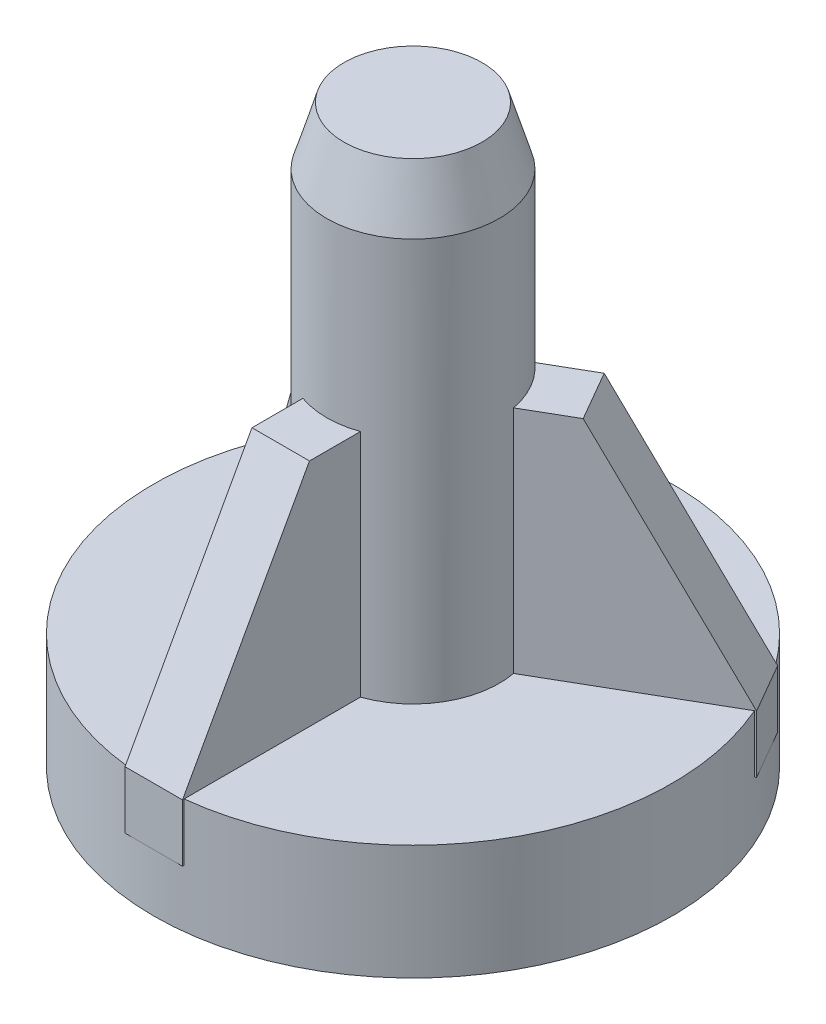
from build123d import *

# Parameters (mm, degrees)
SKETCH_1_R         = 90.152908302
EXTRUDE_357_DEPTH  = 40
EXTRUDE_1_DEPTH    = 10
EXTRUDE_2_DEPTH    = 10
EXTRUDE_3_DEPTH    = 10
SKETCH_6_R         = 30
EXTRUDE_1200_DEPTH = 160
CHAMFER_1_SIZE     = 20
CHAMFER_1_SIZE2    = 6


with BuildPart() as part:
    # Sketch 1 → Extrude 357 (new body)
    with BuildSketch(Plane(origin=(0, 0, 0), x_dir=(1, 0, 0), z_dir=(0, 1, 0))):
        with Locations(Location((0, 0, 0), (0, 0, 270))):
            Circle(SKETCH_1_R)
    extrude(amount=EXTRUDE_357_DEPTH)

    # Sketch 2 → Extrude 1 (add, symmetric)
    with BuildSketch(Plane(origin=(0, 0, 0), x_dir=(0, 0, -1), z_dir=(1, 0, 0))):
        Polygon((-90.152908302, 20), (-90.152908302, 40), (-46, 120), (-28, 120), (-28, 20), align=None)
    extrude(amount=EXTRUDE_1_DEPTH, both=True)

    # Sketch 3 → Extrude 2 (add, symmetric)
    with BuildSketch(Plane(origin=(0, 0, 0), x_dir=(0.8660254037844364, 0, 0.5000000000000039), z_dir=(-0.5000000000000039, 0, 0.8660254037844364))):
        Polygon((-90.152908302, 20), (-90.152908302, 40), (-46, 120), (-28, 120), (-28, 20), align=None)
    extrude(amount=EXTRUDE_2_DEPTH, both=True)

    # Sketch 5 → Extrude 3 (add, symmetric)
    with BuildSketch(Plane(origin=(0, 0, 0), x_dir=(-0.8660254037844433, 0, 0.4999999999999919), z_dir=(-0.49999999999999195, 0, -0.8660254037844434))):
        Polygon((-90.152908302, 20), (-90.152908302, 40), (-46, 120), (-28, 120), (-28, 20), align=None)
    extrude(amount=EXTRUDE_3_DEPTH, both=True)

    # Sketch 6 → Extrude 1200 (add)
    with BuildSketch(Plane(origin=(0, 40, 0), x_dir=(1, 0, 0), z_dir=(0, 1, 0))):
        with Locations(Location((0, 0, 0), (0, 0, 130.528779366))):
            Circle(SKETCH_6_R)
    extrude(amount=EXTRUDE_1200_DEPTH)

    # Chamfer 1
    chamfer_1_edges = [part.edges().sort_by_distance(p)[0] for p in [
        (19.494897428, 200, 22.802389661),
    ]]
    chamfer_1_side = [part.faces().sort_by_distance(p)[0] for p in [
        (19.494897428, 120, 22.802389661),
    ]]
    chamfer(chamfer_1_edges, length=CHAMFER_1_SIZE, length2=CHAMFER_1_SIZE2, reference=chamfer_1_side[0])


solid = part.part
